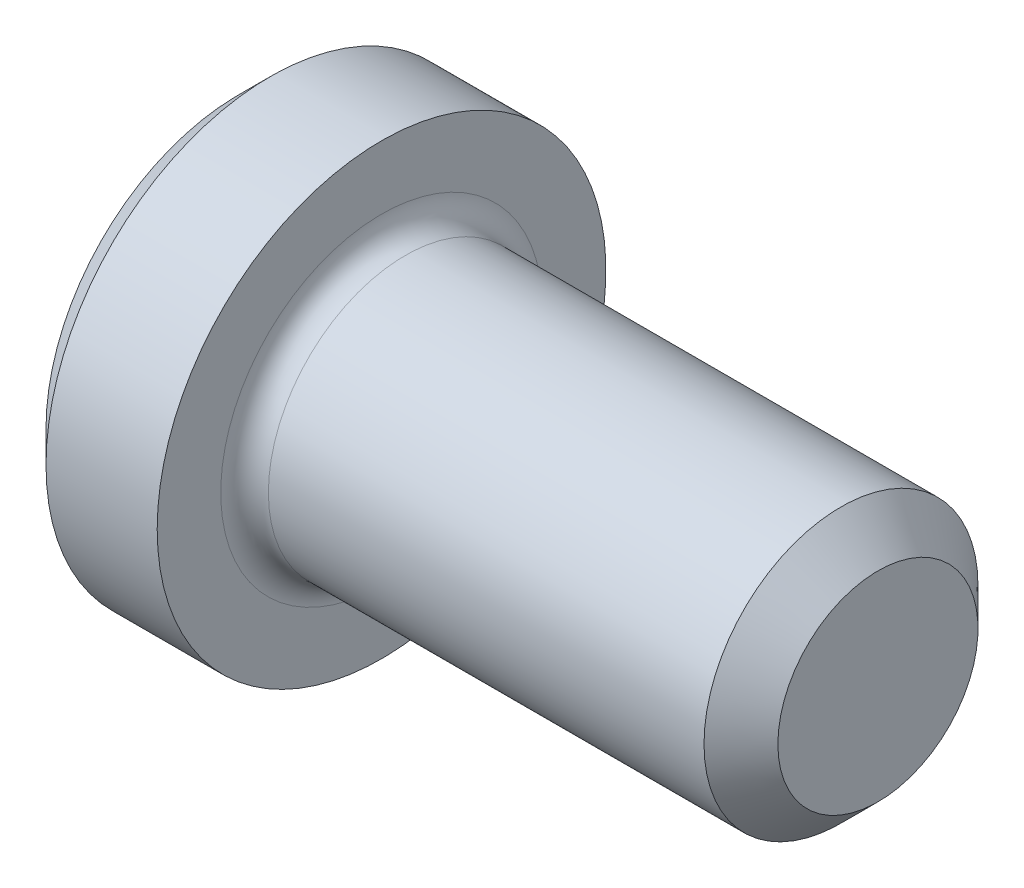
from build123d import *

# Parameters (mm, degrees)
FILLET1_R   = 0.3048
HEX_2_DEPTH = 1.5748


with BuildPart() as part:
    # BodySke → Base-Revolve (revolve)
    with BuildSketch(Plane.XY, mode=Mode.PRIVATE) as base_revolve_sk:
        Polygon((0, 0), (0, 2.4638), (0.4064, 2.8702), (1.8288, 2.8702), (1.8288, 1.7526), (7.70636, 1.7526), (8.1788, 1.28016), (8.1788, 0), align=None)
    revolve(base_revolve_sk.sketch.rotate(Axis((-5.430929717, 0, 0), (1, 0, 0)), 90), axis=Axis((-5.430929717, 0, 0), (1, 0, 0)))

    # Fillet1
    fillet1_edges = [part.edges().sort_by_distance(p)[0] for p in [
        (1.8288, 0, -1.7526),
    ]]
    fillet(fillet1_edges, radius=FILLET1_R)

    # Sketch2 → Hex-PreBroach (revolve, cut)
    with BuildSketch(Plane.XY, mode=Mode.PRIVATE) as hex_prebroach_sk:
        Polygon((0, 0.7874), (1.5748, 0.7874), (2.029405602, 0), (0, 0), align=None)
    revolve(hex_prebroach_sk.sketch.rotate(Axis((0, 0, 0), (1, 0, 0)), 90), axis=Axis((0, 0, 0), (1, 0, 0)), mode=Mode.SUBTRACT)

    # Sketch3 → Hex 2 (cut)
    with BuildSketch(Plane(origin=(0, 0, 0), x_dir=(0, 0.500000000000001, 0.866025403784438), z_dir=(-1, 0, 0))):
        Polygon((0.454605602, 0.7874), (-0.454605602, 0.7874), (-0.909211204, 0), (-0.454605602, -0.7874), (0.454605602, -0.7874), (0.909211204, 0), align=None)
    extrude(amount=-HEX_2_DEPTH, mode=Mode.SUBTRACT)


solid = part.part
